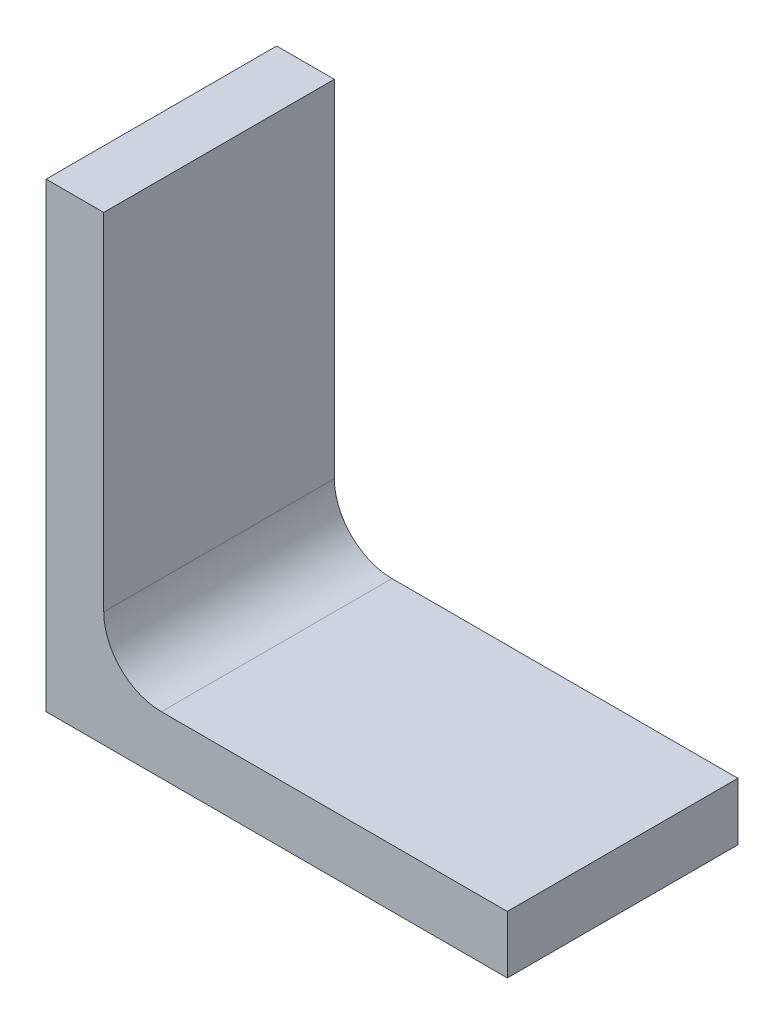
ISO-10303-21;
HEADER;
FILE_DESCRIPTION(('STEP AP214'),'2;1');
FILE_NAME('part.step','',(''),(''),'','','');
FILE_SCHEMA(('AUTOMOTIVE_DESIGN { 1 0 10303 214 1 1 1 1 }'));
ENDSEC;
DATA;
#1=APPLICATION_CONTEXT('core data for automotive mechanical design processes');
#2=APPLICATION_PROTOCOL_DEFINITION('international standard','automotive_design',2000,#1);
#3=PRODUCT_CONTEXT('',#1,'mechanical');
#4=PRODUCT('Part','Part','',(#3));
#5=PRODUCT_RELATED_PRODUCT_CATEGORY('part','',(#4));
#6=PRODUCT_DEFINITION_FORMATION('','',#4);
#7=PRODUCT_DEFINITION_CONTEXT('part definition',#1,'design');
#8=PRODUCT_DEFINITION('design','',#6,#7);
#9=PRODUCT_DEFINITION_SHAPE('','',#8);
#10=(LENGTH_UNIT() NAMED_UNIT(*) SI_UNIT(.MILLI.,.METRE.));
#11=(NAMED_UNIT(*) PLANE_ANGLE_UNIT() SI_UNIT($,.RADIAN.));
#12=(NAMED_UNIT(*) SI_UNIT($,.STERADIAN.) SOLID_ANGLE_UNIT());
#13=UNCERTAINTY_MEASURE_WITH_UNIT(LENGTH_MEASURE(1.E-05),#10,'distance_accuracy_value','');
#14=(GEOMETRIC_REPRESENTATION_CONTEXT(3) GLOBAL_UNCERTAINTY_ASSIGNED_CONTEXT((#13)) GLOBAL_UNIT_ASSIGNED_CONTEXT((#10,
#11,#12)) REPRESENTATION_CONTEXT('',''));
#15=CARTESIAN_POINT('',(0.,0.,0.));
#16=DIRECTION('',(0.,0.,1.));
#17=DIRECTION('',(1.,0.,0.));
#18=AXIS2_PLACEMENT_3D('',#15,#16,#17);
#19=CARTESIAN_POINT('',(50.7999999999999,0.,12.7));
#20=DIRECTION('',(0.,1.,0.));
#21=DIRECTION('',(0.,0.,1.));
#22=AXIS2_PLACEMENT_3D('',#19,#20,#21);
#23=PLANE('',#22);
#24=DIRECTION('',(1.,0.,0.));
#25=VECTOR('',#24,1.);
#26=CARTESIAN_POINT('',(50.7999999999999,0.,-12.7));
#27=LINE('',#26,#25);
#28=CARTESIAN_POINT('',(0.,0.,-12.7));
#29=VERTEX_POINT('',#28);
#30=CARTESIAN_POINT('',(50.7999999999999,0.,-12.7));
#31=VERTEX_POINT('',#30);
#32=EDGE_CURVE('E123',#29,#31,#27,.T.);
#33=ORIENTED_EDGE('',*,*,#32,.T.);
#34=DIRECTION('',(0.,0.,-1.));
#35=VECTOR('',#34,1.);
#36=CARTESIAN_POINT('',(50.7999999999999,0.,12.7));
#37=LINE('',#36,#35);
#38=CARTESIAN_POINT('',(50.7999999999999,0.,12.7));
#39=VERTEX_POINT('',#38);
#40=EDGE_CURVE('E11',#39,#31,#37,.T.);
#41=ORIENTED_EDGE('',*,*,#40,.F.);
#42=DIRECTION('',(1.,0.,0.));
#43=VECTOR('',#42,1.);
#44=CARTESIAN_POINT('',(50.7999999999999,0.,12.7));
#45=LINE('',#44,#43);
#46=CARTESIAN_POINT('',(0.,0.,12.7));
#47=VERTEX_POINT('',#46);
#48=EDGE_CURVE('E135',#47,#39,#45,.T.);
#49=ORIENTED_EDGE('',*,*,#48,.F.);
#50=DIRECTION('',(0.,0.,-1.));
#51=VECTOR('',#50,1.);
#52=CARTESIAN_POINT('',(0.,0.,12.7));
#53=LINE('',#52,#51);
#54=EDGE_CURVE('E119',#47,#29,#53,.T.);
#55=ORIENTED_EDGE('',*,*,#54,.T.);
#56=EDGE_LOOP('',(#33,#41,#49,#55));
#57=FACE_BOUND('',#56,.T.);
#58=ADVANCED_FACE('F33',(#57),#23,.F.);
#59=CARTESIAN_POINT('',(50.7999999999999,0.,12.7));
#60=DIRECTION('',(-1.,0.,0.));
#61=DIRECTION('',(0.,0.,1.));
#62=AXIS2_PLACEMENT_3D('',#59,#60,#61);
#63=PLANE('',#62);
#64=DIRECTION('',(0.,1.,0.));
#65=VECTOR('',#64,1.);
#66=CARTESIAN_POINT('',(50.7999999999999,0.,-12.7));
#67=LINE('',#66,#65);
#68=CARTESIAN_POINT('',(50.7999999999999,6.34999999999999,-12.7));
#69=VERTEX_POINT('',#68);
#70=EDGE_CURVE('E126',#31,#69,#67,.T.);
#71=ORIENTED_EDGE('',*,*,#70,.T.);
#72=DIRECTION('',(0.,0.,-1.));
#73=VECTOR('',#72,1.);
#74=CARTESIAN_POINT('',(50.7999999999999,6.34999999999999,12.7));
#75=LINE('',#74,#73);
#76=CARTESIAN_POINT('',(50.7999999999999,6.34999999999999,12.7));
#77=VERTEX_POINT('',#76);
#78=EDGE_CURVE('E41',#77,#69,#75,.T.);
#79=ORIENTED_EDGE('',*,*,#78,.F.);
#80=DIRECTION('',(0.,1.,0.));
#81=VECTOR('',#80,1.);
#82=CARTESIAN_POINT('',(50.7999999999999,0.,12.7));
#83=LINE('',#82,#81);
#84=EDGE_CURVE('E89',#39,#77,#83,.T.);
#85=ORIENTED_EDGE('',*,*,#84,.F.);
#86=ORIENTED_EDGE('',*,*,#40,.T.);
#87=EDGE_LOOP('',(#71,#79,#85,#86));
#88=FACE_BOUND('',#87,.T.);
#89=ADVANCED_FACE('F160',(#88),#63,.F.);
#90=CARTESIAN_POINT('',(12.7,6.34999999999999,12.7));
#91=DIRECTION('',(0.,-1.,0.));
#92=DIRECTION('',(0.,0.,-1.));
#93=AXIS2_PLACEMENT_3D('',#90,#91,#92);
#94=PLANE('',#93);
#95=DIRECTION('',(-1.,0.,0.));
#96=VECTOR('',#95,1.);
#97=CARTESIAN_POINT('',(12.7,6.34999999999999,-12.7));
#98=LINE('',#97,#96);
#99=CARTESIAN_POINT('',(12.7,6.35,-12.7));
#100=VERTEX_POINT('',#99);
#101=EDGE_CURVE('E128',#69,#100,#98,.T.);
#102=ORIENTED_EDGE('',*,*,#101,.T.);
#103=DIRECTION('',(0.,0.,-1.));
#104=VECTOR('',#103,1.);
#105=CARTESIAN_POINT('',(12.7,6.35,12.7));
#106=LINE('',#105,#104);
#107=CARTESIAN_POINT('',(12.7,6.35,12.7));
#108=VERTEX_POINT('',#107);
#109=EDGE_CURVE('E139',#108,#100,#106,.T.);
#110=ORIENTED_EDGE('',*,*,#109,.F.);
#111=DIRECTION('',(-1.,0.,0.));
#112=VECTOR('',#111,1.);
#113=CARTESIAN_POINT('',(12.7,6.34999999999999,12.7));
#114=LINE('',#113,#112);
#115=EDGE_CURVE('E147',#77,#108,#114,.T.);
#116=ORIENTED_EDGE('',*,*,#115,.F.);
#117=ORIENTED_EDGE('',*,*,#78,.T.);
#118=EDGE_LOOP('',(#102,#110,#116,#117));
#119=FACE_BOUND('',#118,.T.);
#120=ADVANCED_FACE('F145',(#119),#94,.F.);
#121=CARTESIAN_POINT('',(12.7,12.7,12.7));
#122=DIRECTION('',(0.,0.,-1.));
#123=DIRECTION('',(-1.,0.,0.));
#124=AXIS2_PLACEMENT_3D('',#121,#122,#123);
#125=CYLINDRICAL_SURFACE('',#124,6.35);
#126=CARTESIAN_POINT('',(12.7,12.7,-12.7));
#127=DIRECTION('',(0.,0.,-1.));
#128=DIRECTION('',(-1.,0.,0.));
#129=AXIS2_PLACEMENT_3D('',#126,#127,#128);
#130=CIRCLE('',#129,6.35);
#131=CARTESIAN_POINT('',(6.34999999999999,12.7,-12.7));
#132=VERTEX_POINT('',#131);
#133=EDGE_CURVE('E130',#100,#132,#130,.T.);
#134=ORIENTED_EDGE('',*,*,#133,.T.);
#135=DIRECTION('',(0.,0.,-1.));
#136=VECTOR('',#135,1.);
#137=CARTESIAN_POINT('',(6.34999999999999,12.7,12.7));
#138=LINE('',#137,#136);
#139=CARTESIAN_POINT('',(6.34999999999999,12.7,12.7));
#140=VERTEX_POINT('',#139);
#141=EDGE_CURVE('E114',#140,#132,#138,.T.);
#142=ORIENTED_EDGE('',*,*,#141,.F.);
#143=CARTESIAN_POINT('',(12.7,12.7,12.7));
#144=DIRECTION('',(0.,0.,-1.));
#145=DIRECTION('',(-1.,0.,0.));
#146=AXIS2_PLACEMENT_3D('',#143,#144,#145);
#147=CIRCLE('',#146,6.35);
#148=EDGE_CURVE('E105',#108,#140,#147,.T.);
#149=ORIENTED_EDGE('',*,*,#148,.F.);
#150=ORIENTED_EDGE('',*,*,#109,.T.);
#151=EDGE_LOOP('',(#134,#142,#149,#150));
#152=FACE_BOUND('',#151,.T.);
#153=ADVANCED_FACE('F153',(#152),#125,.F.);
#154=CARTESIAN_POINT('',(6.34999999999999,50.8,12.7));
#155=DIRECTION('',(-1.,0.,0.));
#156=DIRECTION('',(0.,-1.,0.));
#157=AXIS2_PLACEMENT_3D('',#154,#155,#156);
#158=PLANE('',#157);
#159=DIRECTION('',(0.,1.,0.));
#160=VECTOR('',#159,1.);
#161=CARTESIAN_POINT('',(6.34999999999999,50.8,-12.7));
#162=LINE('',#161,#160);
#163=CARTESIAN_POINT('',(6.34999999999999,50.8,-12.7));
#164=VERTEX_POINT('',#163);
#165=EDGE_CURVE('E113',#132,#164,#162,.T.);
#166=ORIENTED_EDGE('',*,*,#165,.T.);
#167=DIRECTION('',(0.,0.,-1.));
#168=VECTOR('',#167,1.);
#169=CARTESIAN_POINT('',(6.34999999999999,50.8,12.7));
#170=LINE('',#169,#168);
#171=CARTESIAN_POINT('',(6.34999999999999,50.8,12.7));
#172=VERTEX_POINT('',#171);
#173=EDGE_CURVE('E110',#172,#164,#170,.T.);
#174=ORIENTED_EDGE('',*,*,#173,.F.);
#175=DIRECTION('',(0.,1.,0.));
#176=VECTOR('',#175,1.);
#177=CARTESIAN_POINT('',(6.34999999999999,50.8,12.7));
#178=LINE('',#177,#176);
#179=EDGE_CURVE('E99',#140,#172,#178,.T.);
#180=ORIENTED_EDGE('',*,*,#179,.F.);
#181=ORIENTED_EDGE('',*,*,#141,.T.);
#182=EDGE_LOOP('',(#166,#174,#180,#181));
#183=FACE_BOUND('',#182,.T.);
#184=ADVANCED_FACE('F111',(#183),#158,.F.);
#185=CARTESIAN_POINT('',(0.,50.8,12.7));
#186=DIRECTION('',(0.,-1.,0.));
#187=DIRECTION('',(0.,0.,-1.));
#188=AXIS2_PLACEMENT_3D('',#185,#186,#187);
#189=PLANE('',#188);
#190=DIRECTION('',(-1.,0.,0.));
#191=VECTOR('',#190,1.);
#192=CARTESIAN_POINT('',(0.,50.8,-12.7));
#193=LINE('',#192,#191);
#194=CARTESIAN_POINT('',(0.,50.8,-12.7));
#195=VERTEX_POINT('',#194);
#196=EDGE_CURVE('E75',#164,#195,#193,.T.);
#197=ORIENTED_EDGE('',*,*,#196,.T.);
#198=DIRECTION('',(0.,0.,-1.));
#199=VECTOR('',#198,1.);
#200=CARTESIAN_POINT('',(0.,50.8,12.7));
#201=LINE('',#200,#199);
#202=CARTESIAN_POINT('',(0.,50.8,12.7));
#203=VERTEX_POINT('',#202);
#204=EDGE_CURVE('E115',#203,#195,#201,.T.);
#205=ORIENTED_EDGE('',*,*,#204,.F.);
#206=DIRECTION('',(-1.,0.,0.));
#207=VECTOR('',#206,1.);
#208=CARTESIAN_POINT('',(0.,50.8,12.7));
#209=LINE('',#208,#207);
#210=EDGE_CURVE('E103',#172,#203,#209,.T.);
#211=ORIENTED_EDGE('',*,*,#210,.F.);
#212=ORIENTED_EDGE('',*,*,#173,.T.);
#213=EDGE_LOOP('',(#197,#205,#211,#212));
#214=FACE_BOUND('',#213,.T.);
#215=ADVANCED_FACE('F117',(#214),#189,.F.);
#216=CARTESIAN_POINT('',(0.,0.,12.7));
#217=DIRECTION('',(1.,0.,0.));
#218=DIRECTION('',(0.,1.,0.));
#219=AXIS2_PLACEMENT_3D('',#216,#217,#218);
#220=PLANE('',#219);
#221=DIRECTION('',(0.,-1.,0.));
#222=VECTOR('',#221,1.);
#223=CARTESIAN_POINT('',(0.,0.,-12.7));
#224=LINE('',#223,#222);
#225=EDGE_CURVE('E81',#195,#29,#224,.T.);
#226=ORIENTED_EDGE('',*,*,#225,.T.);
#227=ORIENTED_EDGE('',*,*,#54,.F.);
#228=DIRECTION('',(0.,-1.,0.));
#229=VECTOR('',#228,1.);
#230=CARTESIAN_POINT('',(0.,0.,12.7));
#231=LINE('',#230,#229);
#232=EDGE_CURVE('E49',#203,#47,#231,.T.);
#233=ORIENTED_EDGE('',*,*,#232,.F.);
#234=ORIENTED_EDGE('',*,*,#204,.T.);
#235=EDGE_LOOP('',(#226,#227,#233,#234));
#236=FACE_BOUND('',#235,.T.);
#237=ADVANCED_FACE('F174',(#236),#220,.F.);
#238=CARTESIAN_POINT('',(12.7,12.7,12.7));
#239=DIRECTION('',(0.,0.,-1.));
#240=DIRECTION('',(-1.,0.,0.));
#241=AXIS2_PLACEMENT_3D('',#238,#239,#240);
#242=PLANE('',#241);
#243=ORIENTED_EDGE('',*,*,#48,.T.);
#244=ORIENTED_EDGE('',*,*,#84,.T.);
#245=ORIENTED_EDGE('',*,*,#115,.T.);
#246=ORIENTED_EDGE('',*,*,#148,.T.);
#247=ORIENTED_EDGE('',*,*,#179,.T.);
#248=ORIENTED_EDGE('',*,*,#210,.T.);
#249=ORIENTED_EDGE('',*,*,#232,.T.);
#250=EDGE_LOOP('',(#243,#244,#245,#246,#247,#248,#249));
#251=FACE_BOUND('',#250,.T.);
#252=ADVANCED_FACE('F101',(#251),#242,.F.);
#253=CARTESIAN_POINT('',(12.7,12.7,-12.7));
#254=DIRECTION('',(0.,0.,-1.));
#255=DIRECTION('',(-1.,0.,0.));
#256=AXIS2_PLACEMENT_3D('',#253,#254,#255);
#257=PLANE('',#256);
#258=ORIENTED_EDGE('',*,*,#32,.F.);
#259=ORIENTED_EDGE('',*,*,#225,.F.);
#260=ORIENTED_EDGE('',*,*,#196,.F.);
#261=ORIENTED_EDGE('',*,*,#165,.F.);
#262=ORIENTED_EDGE('',*,*,#133,.F.);
#263=ORIENTED_EDGE('',*,*,#101,.F.);
#264=ORIENTED_EDGE('',*,*,#70,.F.);
#265=EDGE_LOOP('',(#258,#259,#260,#261,#262,#263,#264));
#266=FACE_BOUND('',#265,.T.);
#267=ADVANCED_FACE('F151',(#266),#257,.T.);
#268=CLOSED_SHELL('',(#58,#89,#120,#153,#184,#215,#237,#252,#267));
#269=MANIFOLD_SOLID_BREP('B2',#268);
#270=ADVANCED_BREP_SHAPE_REPRESENTATION('',(#18,#269),#14);
#271=SHAPE_DEFINITION_REPRESENTATION(#9,#270);
ENDSEC;
END-ISO-10303-21;
